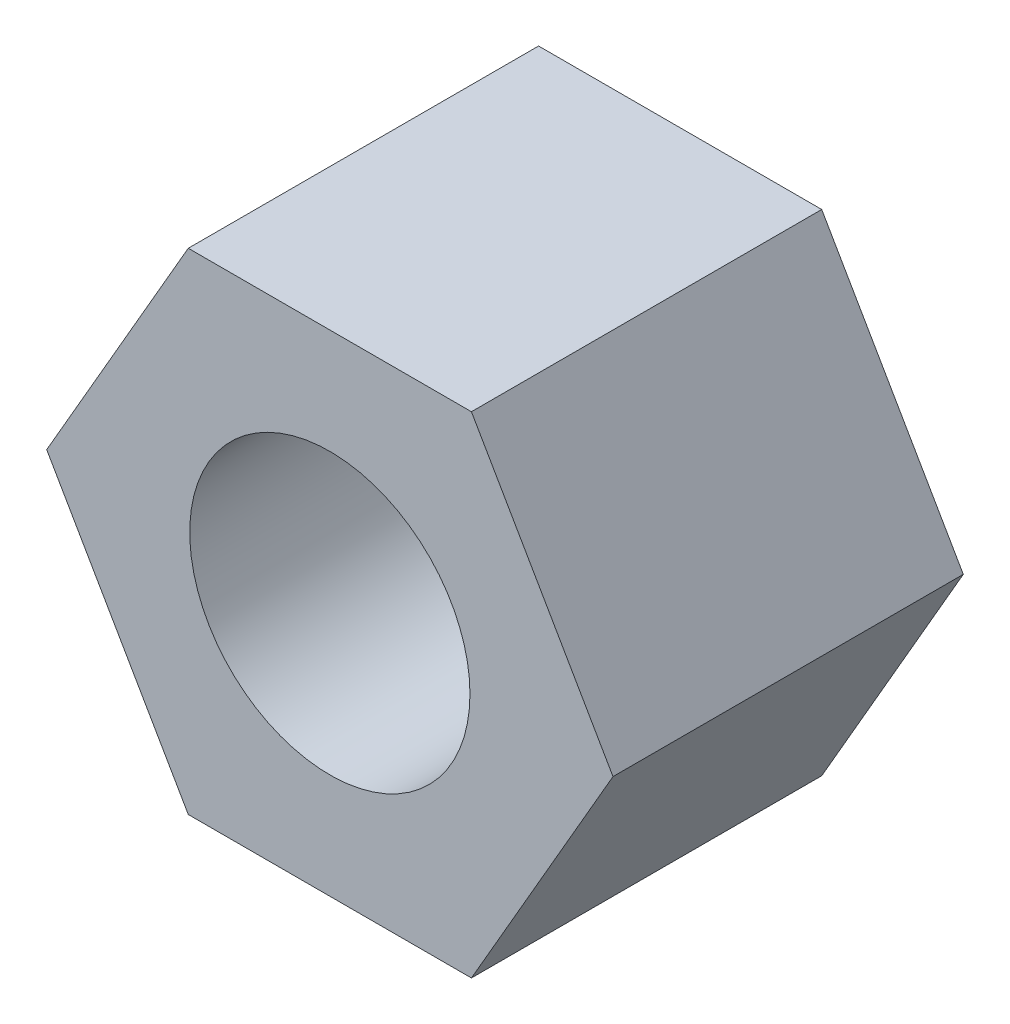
from build123d import *

# Parameters (mm, degrees)
SKETCH_1_R                     = 2
NYLOCK_EXTERNAL_ENVELOPE_DEPTH = 5


with BuildPart() as part:
    # Sketch 1 → Nylock_external_envelope (new body)
    with BuildSketch(Plane.XY):
        Polygon((4.041451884, 0), (2.020725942, 3.5), (-2.020725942, 3.5), (-4.041451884, 0), (-2.020725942, -3.5), (2.020725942, -3.5), align=None)
        Circle(SKETCH_1_R, mode=Mode.SUBTRACT)
    extrude(amount=NYLOCK_EXTERNAL_ENVELOPE_DEPTH)


solid = part.part
